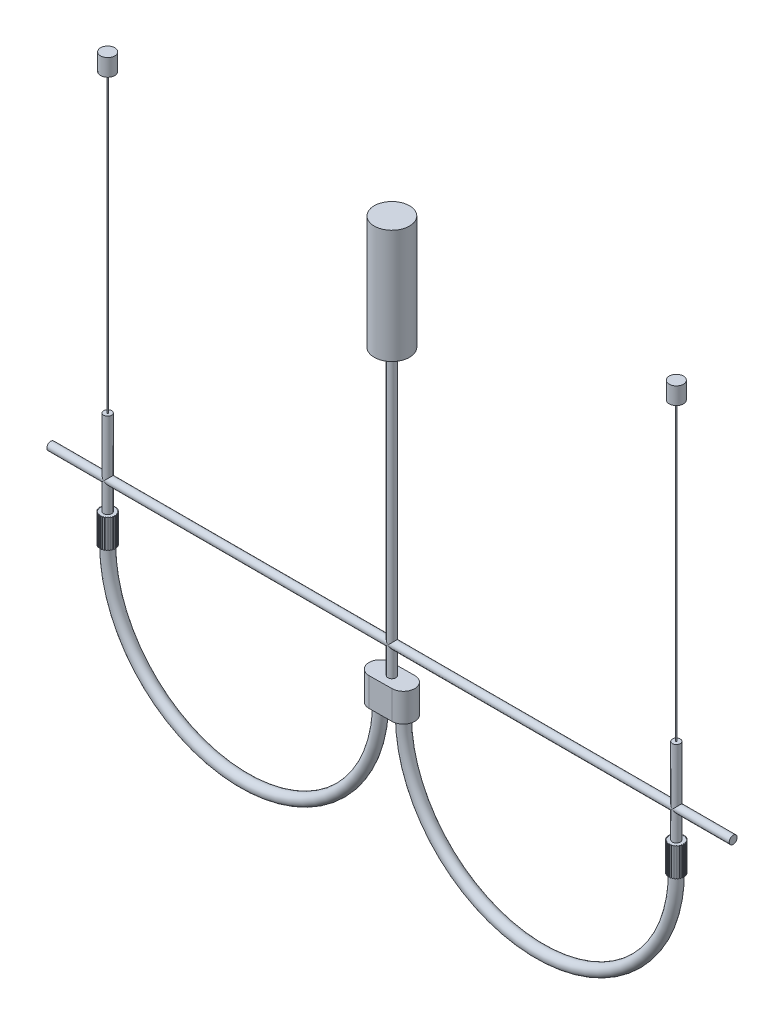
from build123d import *

# Parameters (mm, degrees)
CROQUIS1_R                     = 31
SALIENTE_EXTRUIR1_DEPTH        = 200
CROQUIS2_R                     = 7
SALIENTE_EXTRUIR2_DEPTH        = 500
SALIENTE_EXTRUIR3_DEPTH        = 50
CROQUIS4_R                     = 10
CORTAR_EXTRUIR1_DEPTH          = 20
BARRER1_PROFILE_R              = 7
SALIENTE_EXTRUIR4_DEPTH        = 50
SALIENTE_EXTRUIR4_DEPTH_BACK   = 100
CROQUIS18_R                    = 7
SALIENTE_EXTRUIR4_2_DEPTH      = 50
SALIENTE_EXTRUIR4_2_DEPTH_BACK = 100
CROQUIS19_R                    = 12.5
SALIENTE_EXTRUIR5_DEPTH        = 50
SALIENTE_EXTRUIR5_2_DEPTH      = 50
BARRER2_PROFILE_R              = 10
BARRER3_PROFILE_R              = 10
CROQUIS46_R                    = 1
SALIENTE_EXTRUIR6_DEPTH        = 520
SALIENTE_EXTRUIR6_2_DEPTH      = 520
CROQUIS47_R                    = 12.5
SALIENTE_EXTRUIR7_DEPTH        = 30
SALIENTE_EXTRUIR7_2_DEPTH      = 30
CROQUIS48_W                    = 2
CROQUIS48_H                    = 2
SALIENTE_EXTRUIR8_DEPTH        = 50
CROQUIS49_W                    = 2
CROQUIS49_H                    = 2
SALIENTE_EXTRUIR9_DEPTH        = 50


with BuildPart() as part:
    # Croquis1 → Saliente-Extruir1 (new body)
    with BuildSketch(Plane(origin=(0, 0, 0), x_dir=(1, 0, 0), z_dir=(0, 1, 0))):
        with Locations(Location((0, 0, 0), (0, 0, 270))):
            Circle(CROQUIS1_R)
    extrude(amount=SALIENTE_EXTRUIR1_DEPTH)

    # Croquis2 → Saliente-Extruir2 (add)
    with BuildSketch(Plane.XZ):
        with Locations(Location((0, 0, 0), (0, 0, 270))):
            Circle(CROQUIS2_R)
    extrude(amount=SALIENTE_EXTRUIR2_DEPTH)

    # Barrer1: sweep along a path in Croquis5
    with BuildLine(Plane.XY) as barrer1_path:
        Line((-599.770788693, -450), (600.229211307, -450))
    # Barrer1 profile (on start of the path) → Barrer1 (sweep)
    with BuildSketch(Plane(origin=(-599.770788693, -450, 0), x_dir=(0, 0, 1), z_dir=(1, 0, 0))):
        Circle(BARRER1_PROFILE_R)
    sweep(path=barrer1_path.line)


with BuildPart() as body_2:
    # Croquis3 → Saliente-Extruir3 (new body)
    with BuildSketch(Plane.XZ.offset(500)):
        with BuildLine():
            Line((-19.770788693, 20.227912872), (20.229211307, 19.76946015))
            ThreePointArc((20.229211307, 19.76946015), (39.998686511, -0.458437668), (19.770788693, -20.227912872))
            Line((19.770788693, -20.227912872), (-20.229211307, -19.76946015))
            ThreePointArc((-20.229211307, -19.76946015), (-39.998686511, 0.458437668), (-19.770788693, 20.227912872))
        make_face()
    extrude(amount=SALIENTE_EXTRUIR3_DEPTH)

    # Croquis4 → Cortar-Extruir1 (cut)
    with BuildSketch(Plane.XZ.offset(550)):
        with Locations(Location((-20, 0, 0), (0, 0, 270))):
            Circle(CROQUIS4_R)
        with Locations(Location((20, 0, 0), (0, 0, 270))):
            Circle(CROQUIS4_R)
    extrude(amount=-CORTAR_EXTRUIR1_DEPTH, mode=Mode.SUBTRACT)


with BuildPart() as body_3:
    # Croquis18 → Saliente-Extruir4 (new, two sides: drawn at the far end of the back side and taken through both)
    with BuildSketch(Plane(origin=(0, -450, 0), x_dir=(-1, 0, 0), z_dir=(0, -1, 0)).offset(-SALIENTE_EXTRUIR4_DEPTH_BACK)):
        with Locations(Location((499.770788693, 0, 0), (0, 0, 90))):
            Circle(CROQUIS18_R)
    extrude(amount=SALIENTE_EXTRUIR4_DEPTH + SALIENTE_EXTRUIR4_DEPTH_BACK)


with BuildPart() as body_4:
    # Croquis18 → Saliente-Extruir4 2 (new, two sides: drawn at the far end of the back side and taken through both)
    with BuildSketch(Plane(origin=(0, -450, 0), x_dir=(-1, 0, 0), z_dir=(0, -1, 0)).offset(-SALIENTE_EXTRUIR4_2_DEPTH_BACK)):
        with Locations(Location((-500.229211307, 0, 0), (0, 0, 90))):
            Circle(CROQUIS18_R)
    extrude(amount=SALIENTE_EXTRUIR4_2_DEPTH + SALIENTE_EXTRUIR4_2_DEPTH_BACK)


with BuildPart() as body_5:
    # Croquis19 → Saliente-Extruir5 (new body)
    with BuildSketch(Plane.XZ.offset(500)):
        with Locations(Location((-499.770788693, 0, 0), (0, 0, 270))):
            Circle(CROQUIS19_R)
    extrude(amount=SALIENTE_EXTRUIR5_DEPTH)



with BuildPart() as body_6:
    # Croquis19 → Saliente-Extruir5 2 (new body)
    with BuildSketch(Plane.XZ.offset(500)):
        with Locations(Location((500.229211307, 0, 0), (0, 0, 270))):
            Circle(CROQUIS19_R)
    extrude(amount=SALIENTE_EXTRUIR5_2_DEPTH)



with BuildPart() as body_7:
    # Barrer2: sweep along a path in Croquis20
    with BuildLine(Plane.XY) as barrer2_path:
        ThreePointArc((-499.770788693, -550), (-259.770788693, -790), (-19.770788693, -550))
    # Barrer2 profile (on start of the path) → Barrer2 (sweep)
    with BuildSketch(Plane(origin=(-499.770788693, -550, 0), x_dir=(0, 0, -1), z_dir=(0, -1, 0))):
        Circle(BARRER2_PROFILE_R)
    sweep(path=barrer2_path.line)


with BuildPart() as body_8:
    # Barrer3: sweep along a path in Croquis33
    with BuildLine(Plane.XY) as barrer3_path:
        ThreePointArc((20.229211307, -550), (260.229211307, -790), (500.229211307, -550))
    # Barrer3 profile (on start of the path) → Barrer3 (sweep)
    with BuildSketch(Plane(origin=(20.229211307, -550, 0), x_dir=(-1, 0, 0), z_dir=(0, -1, 0))):
        Circle(BARRER3_PROFILE_R)
    sweep(path=barrer3_path.line)


with BuildPart() as body_9:
    # Croquis46 → Saliente-Extruir6 (new body)
    with BuildSketch(Plane(origin=(0, -350, 0), x_dir=(1, 0, 0), z_dir=(0, 1, 0))):
        with Locations(Location((500.229211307, 0, 0), (0, 0, 270))):
            Circle(CROQUIS46_R)
    extrude(amount=SALIENTE_EXTRUIR6_DEPTH)


with BuildPart() as body_10:
    # Croquis46 → Saliente-Extruir6 2 (new body)
    with BuildSketch(Plane(origin=(0, -350, 0), x_dir=(1, 0, 0), z_dir=(0, 1, 0))):
        with Locations(Location((-499.770788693, 0, 0), (0, 0, 270))):
            Circle(CROQUIS46_R)
    extrude(amount=SALIENTE_EXTRUIR6_2_DEPTH)


with BuildPart() as body_11:
    # Croquis47 → Saliente-Extruir7 (new body)
    with BuildSketch(Plane(origin=(0, 170, 0), x_dir=(1, 0, 0), z_dir=(0, 1, 0))):
        with Locations(Location((500.229211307, 0, 0), (0, 0, 270))):
            Circle(CROQUIS47_R)
    extrude(amount=SALIENTE_EXTRUIR7_DEPTH)


with BuildPart() as body_12:
    # Croquis47 → Saliente-Extruir7 2 (new body)
    with BuildSketch(Plane(origin=(0, 170, 0), x_dir=(1, 0, 0), z_dir=(0, 1, 0))):
        with Locations(Location((-499.770788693, 0, 0), (0, 0, 270))):
            Circle(CROQUIS47_R)
    extrude(amount=SALIENTE_EXTRUIR7_2_DEPTH)


with BuildPart() as body_6_1:
    add(body_6.part)

    add(body_8.part)  # Saliente-Extruir8 merges body 8
    # Croquis48 → Saliente-Extruir8 (add)
    with BuildSketch(Plane(origin=(0, -500, 0), x_dir=(1, 0, 0), z_dir=(0, 1, 0))):
        Polygon((486.904648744, 2.388730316), (487.402028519, 4.325896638), (489.339194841, 3.828516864), (488.841815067, 1.891350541), align=None)
        with Locations((487.729211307, 0)):
            Rectangle(CROQUIS48_W, CROQUIS48_H)
        Polygon((487.917317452, 5.62736792), (488.8808248, 7.37998128), (490.63343816, 6.416473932), (489.669930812, 4.663860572), align=None)
        Polygon((489.703587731, 8.512417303), (491.072681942, 9.970354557), (492.530619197, 8.601260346), (491.161524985, 7.143323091), align=None)
        Polygon((492.151221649, 10.862600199), (493.8398775, 11.934253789), (494.91153109, 10.245597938), (493.222875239, 9.173944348), align=None)
        Polygon((495.106425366, 12.530245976), (497.008538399, 13.148279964), (497.626572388, 11.246166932), (495.724459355, 10.628132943), align=None)
        Polygon((498.383512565, 13.410570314), (500.379566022, 13.536151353), (500.505147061, 11.540097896), (498.509093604, 11.414516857), align=None)
        Polygon((501.776571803, 13.448259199), (503.741146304, 13.07349657), (503.366383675, 11.108922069), (501.401809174, 11.483684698), align=None)
        Polygon((505.07240469, 12.6409445), (506.882058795, 11.789385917), (506.030500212, 9.979731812), (504.220846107, 10.831290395), align=None)
        Polygon((508.063921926, 11.039352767), (509.604948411, 9.764504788), (508.330100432, 8.223478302), (506.789073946, 9.498326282), align=None)
        Polygon((510.563155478, 8.7441179), (511.738725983, 7.126083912), (510.120691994, 5.950513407), (508.94512149, 7.568547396), align=None)
        Polygon((512.413069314, 5.899457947), (513.149318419, 4.039904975), (511.289765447, 3.30365587), (510.553516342, 5.163208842), align=None)
        Polygon((513.497426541, 2.684113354), (513.748093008, 0.699883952), (511.763863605, 0.449217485), (511.513197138, 2.433446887), align=None)
        Polygon((513.748093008, -0.699883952), (513.497426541, -2.684113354), (511.513197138, -2.433446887), (511.763863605, -0.449217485), align=None)
        Polygon((513.149318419, -4.039904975), (512.413069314, -5.899457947), (510.553516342, -5.163208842), (511.289765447, -3.30365587), align=None)
        Polygon((511.738725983, -7.126083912), (510.563155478, -8.7441179), (508.94512149, -7.568547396), (510.120691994, -5.950513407), align=None)
        Polygon((509.604948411, -9.764504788), (508.063921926, -11.039352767), (506.789073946, -9.498326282), (508.330100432, -8.223478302), align=None)
        Polygon((506.882058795, -11.789385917), (505.07240469, -12.6409445), (504.220846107, -10.831290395), (506.030500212, -9.979731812), align=None)
        Polygon((503.741146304, -13.07349657), (501.776571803, -13.448259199), (501.401809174, -11.483684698), (503.366383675, -11.108922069), align=None)
        Polygon((500.379566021, -13.536151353), (498.383512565, -13.410570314), (498.509093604, -11.414516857), (500.505147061, -11.540097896), align=None)
        Polygon((497.008538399, -13.148279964), (495.106425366, -12.530245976), (495.724459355, -10.628132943), (497.626572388, -11.246166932), align=None)
        Polygon((493.8398775, -11.934253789), (492.151221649, -10.862600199), (493.222875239, -9.173944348), (494.91153109, -10.245597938), align=None)
        Polygon((491.072681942, -9.970354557), (489.703587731, -8.512417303), (491.161524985, -7.143323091), (492.530619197, -8.601260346), align=None)
        Polygon((488.8808248, -7.37998128), (487.917317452, -5.62736792), (489.669930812, -4.663860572), (490.63343816, -6.416473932), align=None)
        Polygon((487.402028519, -4.325896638), (486.904648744, -2.388730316), (488.841815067, -1.891350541), (489.339194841, -3.828516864), align=None)
    extrude(amount=-SALIENTE_EXTRUIR8_DEPTH)


with BuildPart() as body_5_1:
    add(body_5.part)

    add(body_7.part)  # Saliente-Extruir9 merges body 7
    # Croquis49 → Saliente-Extruir9 (add)
    with BuildSketch(Plane(origin=(0, -500, 0), x_dir=(1, 0, 0), z_dir=(0, 1, 0))):
        Polygon((-513.095351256, 2.388730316), (-512.597971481, 4.325896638), (-510.660805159, 3.828516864), (-511.158184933, 1.891350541), align=None)
        with Locations((-512.270788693, 0)):
            Rectangle(CROQUIS49_W, CROQUIS49_H)
        Polygon((-512.082682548, 5.62736792), (-511.1191752, 7.37998128), (-509.36656184, 6.416473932), (-510.330069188, 4.663860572), align=None)
        Polygon((-510.296412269, 8.512417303), (-508.927318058, 9.970354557), (-507.469380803, 8.601260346), (-508.838475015, 7.143323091), align=None)
        Polygon((-507.848778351, 10.862600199), (-506.1601225, 11.934253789), (-505.08846891, 10.245597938), (-506.777124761, 9.173944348), align=None)
        Polygon((-504.893574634, 12.530245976), (-502.991461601, 13.148279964), (-502.373427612, 11.246166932), (-504.275540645, 10.628132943), align=None)
        Polygon((-501.616487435, 13.410570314), (-499.620433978, 13.536151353), (-499.494852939, 11.540097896), (-501.490906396, 11.414516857), align=None)
        Polygon((-498.223428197, 13.448259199), (-496.258853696, 13.07349657), (-496.633616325, 11.108922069), (-498.598190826, 11.483684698), align=None)
        Polygon((-494.92759531, 12.6409445), (-493.117941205, 11.789385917), (-493.969499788, 9.979731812), (-495.779153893, 10.831290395), align=None)
        Polygon((-491.936078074, 11.039352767), (-490.395051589, 9.764504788), (-491.669899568, 8.223478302), (-493.210926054, 9.498326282), align=None)
        Polygon((-489.436844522, 8.7441179), (-488.261274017, 7.126083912), (-489.879308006, 5.950513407), (-491.05487851, 7.568547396), align=None)
        Polygon((-487.586930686, 5.899457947), (-486.850681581, 4.039904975), (-488.710234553, 3.30365587), (-489.446483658, 5.163208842), align=None)
        Polygon((-486.502573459, 2.684113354), (-486.251906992, 0.699883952), (-488.236136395, 0.449217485), (-488.486802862, 2.433446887), align=None)
        Polygon((-486.251906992, -0.699883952), (-486.502573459, -2.684113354), (-488.486802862, -2.433446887), (-488.236136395, -0.449217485), align=None)
        Polygon((-486.850681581, -4.039904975), (-487.586930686, -5.899457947), (-489.446483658, -5.163208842), (-488.710234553, -3.30365587), align=None)
        Polygon((-488.261274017, -7.126083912), (-489.436844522, -8.7441179), (-491.05487851, -7.568547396), (-489.879308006, -5.950513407), align=None)
        Polygon((-490.395051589, -9.764504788), (-491.936078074, -11.039352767), (-493.210926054, -9.498326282), (-491.669899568, -8.223478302), align=None)
        Polygon((-493.117941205, -11.789385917), (-494.92759531, -12.6409445), (-495.779153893, -10.831290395), (-493.969499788, -9.979731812), align=None)
        Polygon((-496.258853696, -13.07349657), (-498.223428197, -13.448259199), (-498.598190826, -11.483684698), (-496.633616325, -11.108922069), align=None)
        Polygon((-499.620433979, -13.536151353), (-501.616487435, -13.410570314), (-501.490906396, -11.414516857), (-499.494852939, -11.540097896), align=None)
        Polygon((-502.991461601, -13.148279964), (-504.893574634, -12.530245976), (-504.275540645, -10.628132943), (-502.373427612, -11.246166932), align=None)
        Polygon((-506.1601225, -11.934253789), (-507.848778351, -10.862600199), (-506.777124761, -9.173944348), (-505.08846891, -10.245597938), align=None)
        Polygon((-508.927318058, -9.970354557), (-510.296412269, -8.512417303), (-508.838475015, -7.143323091), (-507.469380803, -8.601260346), align=None)
        Polygon((-511.1191752, -7.37998128), (-512.082682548, -5.62736792), (-510.330069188, -4.663860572), (-509.36656184, -6.416473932), align=None)
        Polygon((-512.597971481, -4.325896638), (-513.095351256, -2.388730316), (-511.158184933, -1.891350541), (-510.660805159, -3.828516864), align=None)
    extrude(amount=-SALIENTE_EXTRUIR9_DEPTH)


solid = Compound([part.part, body_2.part, body_3.part, body_4.part, body_9.part, body_10.part, body_11.part, body_12.part, body_6_1.part, body_5_1.part])
